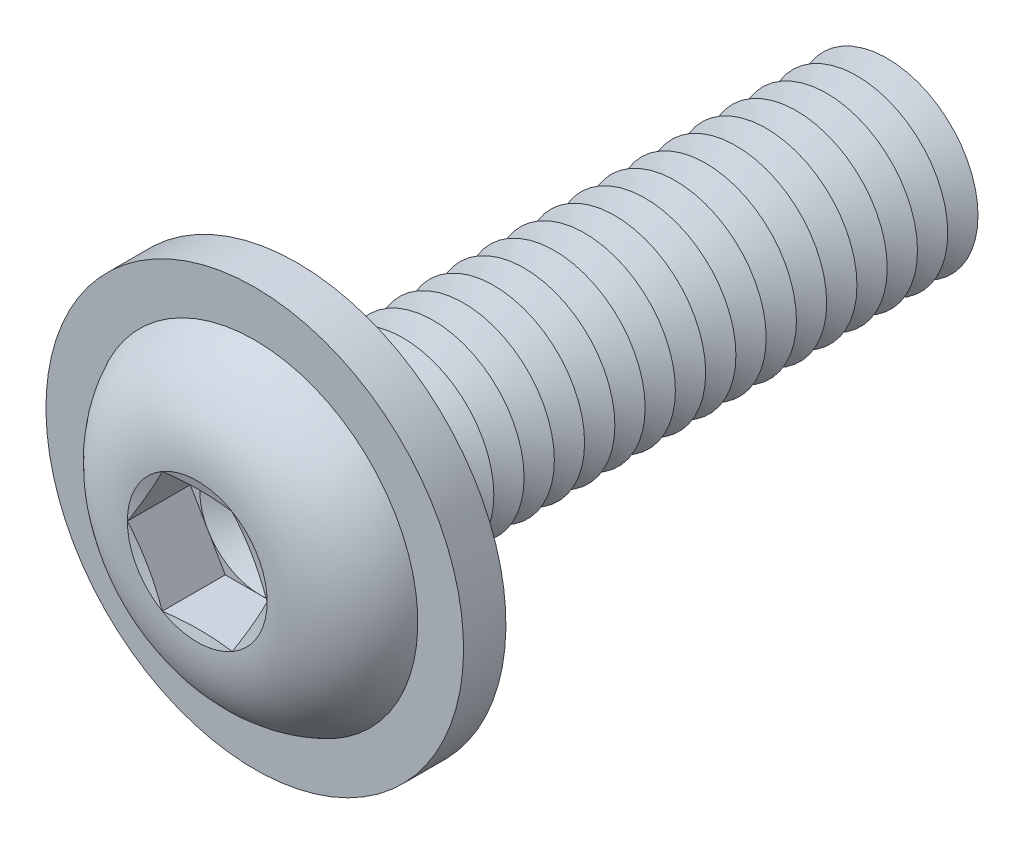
from build123d import *

# Parameters (mm, degrees)
FILLET1_R           = 0.25
LPATTERN1_COUNT     = 20
LPATTERN1_PITCH     = 0.5
CUT_EXTRUDE1_DEPTH  = 1.04
SKETCH5_R           = 3.45
SKETCH5_R_2         = 1.75
BOSS_EXTRUDE1_DEPTH = 0.7


with BuildPart() as part:
    # Sketch1 → Revolve1 (revolve)
    with BuildSketch(Plane(origin=(0, 0, 0), x_dir=(0, 0, -1), z_dir=(1, 0, 0)), mode=Mode.PRIVATE) as revolve1_sk:
        with BuildLine():
            Line((0, 1.5), (0, 2.85))
            ThreePointArc((0, 2.85), (-1.182850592, 2.35063849), (-1.65, 1.1547))
            Line((-1.65, 1.1547), (-1.495299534, 0.57735))
            Line((-1.495299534, 0.57735), (-1.65, 0.57735))
            Line((-1.65, 0.57735), (-1.65, 0))
            Line((-1.65, 0), (10, 0))
            Line((10, 0), (10, 1.5))
            Line((10, 1.5), (0, 1.5))
        make_face()
    revolve(revolve1_sk.sketch.rotate(Axis((0, 0, -10), (0, 0, 1)), 90), axis=Axis((0, 0, -10), (0, 0, 1)))

    # Fillet1
    fillet1_edges = [part.edges().sort_by_distance(p)[0] for p in [
        (1.5, 0, 0),
    ]]
    fillet(fillet1_edges, radius=FILLET1_R)

    # Sketch2 → Cut-Revolve1 (revolve, cut)
    with BuildSketch(Plane(origin=(0, 0, 0), x_dir=(0, 0, -1), z_dir=(1, 0, 0)), mode=Mode.PRIVATE) as cut_revolve1_sk:
        Polygon((9.75, 1.5), (10.25, 1.5), (10, 1.066987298), align=None)
    cut_revolve1 = revolve(cut_revolve1_sk.sketch.rotate(Axis((0, 0, -10), (0, 0, -1)), 270), axis=Axis((0, 0, -10), (0, 0, -1)), mode=Mode.SUBTRACT)

    # LPattern1: Cut-Revolve1 ×20
    with Locations(*[(0, 0, i * LPATTERN1_PITCH) for i in range(1, LPATTERN1_COUNT)]):
        add(cut_revolve1, mode=Mode.SUBTRACT)

    # Sketch3 → Cut-Extrude1 (cut)
    with BuildSketch(Plane.XY.offset(1.65)):
        Polygon((0.57735, 0.999999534), (-0.57735, 0.999999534), (-1.1547, 0), (-0.57735, -0.999999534), (0.57735, -0.999999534), (1.1547, 0), align=None)
    extrude(amount=-CUT_EXTRUDE1_DEPTH, mode=Mode.SUBTRACT)

    # Cut-Extrude2 cone 1 section (on through the dimple's axis) → Cut-Extrude2 (revolve, cut)
    with BuildSketch(Plane(origin=(0, 0, 0.61), x_dir=(0, -1, 0), z_dir=(1, 0, 0))):
        Polygon((0, 0), (0.999999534, 0), (0, 0.57735), align=None)
    revolve(axis=Axis((0, 0, 0.61), (0, 0, -1)), mode=Mode.SUBTRACT)

    # Sketch5 → Boss-Extrude1 (add)
    with BuildSketch(Plane(origin=(0, 0, 0), x_dir=(-1, 0, 0), z_dir=(0, 0, -1))):
        with Locations(Location((0, 0, 0), (0, 0, 90))):
            Circle(SKETCH5_R)
        Circle(SKETCH5_R_2, mode=Mode.SUBTRACT)
    extrude(amount=-BOSS_EXTRUDE1_DEPTH)


solid = part.part
